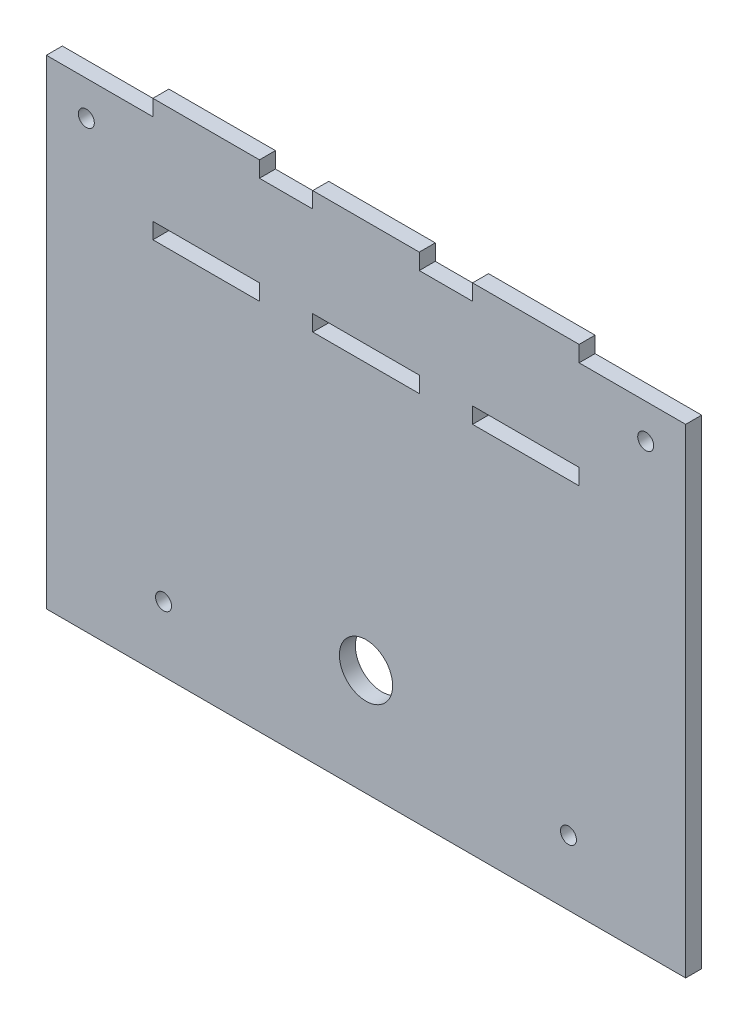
ISO-10303-21;
HEADER;
FILE_DESCRIPTION(('STEP AP214'),'2;1');
FILE_NAME('part.step','',(''),(''),'','','');
FILE_SCHEMA(('AUTOMOTIVE_DESIGN { 1 0 10303 214 1 1 1 1 }'));
ENDSEC;
DATA;
#1=APPLICATION_CONTEXT('core data for automotive mechanical design processes');
#2=APPLICATION_PROTOCOL_DEFINITION('international standard','automotive_design',2000,#1);
#3=PRODUCT_CONTEXT('',#1,'mechanical');
#4=PRODUCT('Part','Part','',(#3));
#5=PRODUCT_RELATED_PRODUCT_CATEGORY('part','',(#4));
#6=PRODUCT_DEFINITION_FORMATION('','',#4);
#7=PRODUCT_DEFINITION_CONTEXT('part definition',#1,'design');
#8=PRODUCT_DEFINITION('design','',#6,#7);
#9=PRODUCT_DEFINITION_SHAPE('','',#8);
#10=(LENGTH_UNIT() NAMED_UNIT(*) SI_UNIT(.MILLI.,.METRE.));
#11=(NAMED_UNIT(*) PLANE_ANGLE_UNIT() SI_UNIT($,.RADIAN.));
#12=(NAMED_UNIT(*) SI_UNIT($,.STERADIAN.) SOLID_ANGLE_UNIT());
#13=UNCERTAINTY_MEASURE_WITH_UNIT(LENGTH_MEASURE(1.E-05),#10,'distance_accuracy_value','');
#14=(GEOMETRIC_REPRESENTATION_CONTEXT(3) GLOBAL_UNCERTAINTY_ASSIGNED_CONTEXT((#13)) GLOBAL_UNIT_ASSIGNED_CONTEXT((#10,
#11,#12)) REPRESENTATION_CONTEXT('',''));
#15=CARTESIAN_POINT('',(0.,0.,0.));
#16=DIRECTION('',(0.,0.,1.));
#17=DIRECTION('',(1.,0.,0.));
#18=AXIS2_PLACEMENT_3D('',#15,#16,#17);
#19=CARTESIAN_POINT('',(-40.,0.,3.));
#20=DIRECTION('',(-1.,0.,0.));
#21=DIRECTION('',(0.,0.,1.));
#22=AXIS2_PLACEMENT_3D('',#19,#20,#21);
#23=PLANE('',#22);
#24=DIRECTION('',(0.,1.,0.));
#25=VECTOR('',#24,1.);
#26=CARTESIAN_POINT('',(-40.,0.,0.));
#27=LINE('',#26,#25);
#28=CARTESIAN_POINT('',(-40.,-23.,0.));
#29=VERTEX_POINT('',#28);
#30=CARTESIAN_POINT('',(-40.,-20.,0.));
#31=VERTEX_POINT('',#30);
#32=EDGE_CURVE('E342',#29,#31,#27,.T.);
#33=ORIENTED_EDGE('',*,*,#32,.T.);
#34=DIRECTION('',(0.,0.,-1.));
#35=VECTOR('',#34,1.);
#36=CARTESIAN_POINT('',(-40.,-20.,3.));
#37=LINE('',#36,#35);
#38=CARTESIAN_POINT('',(-40.,-20.,3.));
#39=VERTEX_POINT('',#38);
#40=EDGE_CURVE('E11',#39,#31,#37,.T.);
#41=ORIENTED_EDGE('',*,*,#40,.F.);
#42=DIRECTION('',(0.,1.,0.));
#43=VECTOR('',#42,1.);
#44=CARTESIAN_POINT('',(-40.,0.,3.));
#45=LINE('',#44,#43);
#46=CARTESIAN_POINT('',(-40.,-23.,3.));
#47=VERTEX_POINT('',#46);
#48=EDGE_CURVE('E242',#47,#39,#45,.T.);
#49=ORIENTED_EDGE('',*,*,#48,.F.);
#50=DIRECTION('',(0.,0.,-1.));
#51=VECTOR('',#50,1.);
#52=CARTESIAN_POINT('',(-40.,-23.,3.));
#53=LINE('',#52,#51);
#54=EDGE_CURVE('E352',#47,#29,#53,.T.);
#55=ORIENTED_EDGE('',*,*,#54,.T.);
#56=EDGE_LOOP('',(#33,#41,#49,#55));
#57=FACE_BOUND('',#56,.T.);
#58=ADVANCED_FACE('F39',(#57),#23,.F.);
#59=CARTESIAN_POINT('',(0.,-20.,3.));
#60=DIRECTION('',(0.,1.,0.));
#61=DIRECTION('',(0.,0.,1.));
#62=AXIS2_PLACEMENT_3D('',#59,#60,#61);
#63=PLANE('',#62);
#64=DIRECTION('',(1.,0.,0.));
#65=VECTOR('',#64,1.);
#66=CARTESIAN_POINT('',(0.,-20.,0.));
#67=LINE('',#66,#65);
#68=CARTESIAN_POINT('',(-20.,-20.,0.));
#69=VERTEX_POINT('',#68);
#70=EDGE_CURVE('E247',#31,#69,#67,.T.);
#71=ORIENTED_EDGE('',*,*,#70,.T.);
#72=DIRECTION('',(0.,0.,-1.));
#73=VECTOR('',#72,1.);
#74=CARTESIAN_POINT('',(-20.,-20.,3.));
#75=LINE('',#74,#73);
#76=CARTESIAN_POINT('',(-20.,-20.,3.));
#77=VERTEX_POINT('',#76);
#78=EDGE_CURVE('E49',#77,#69,#75,.T.);
#79=ORIENTED_EDGE('',*,*,#78,.F.);
#80=DIRECTION('',(1.,0.,0.));
#81=VECTOR('',#80,1.);
#82=CARTESIAN_POINT('',(0.,-20.,3.));
#83=LINE('',#82,#81);
#84=EDGE_CURVE('E235',#39,#77,#83,.T.);
#85=ORIENTED_EDGE('',*,*,#84,.F.);
#86=ORIENTED_EDGE('',*,*,#40,.T.);
#87=EDGE_LOOP('',(#71,#79,#85,#86));
#88=FACE_BOUND('',#87,.T.);
#89=ADVANCED_FACE('F246',(#88),#63,.F.);
#90=CARTESIAN_POINT('',(-20.,0.,3.));
#91=DIRECTION('',(1.,0.,0.));
#92=DIRECTION('',(0.,0.,-1.));
#93=AXIS2_PLACEMENT_3D('',#90,#91,#92);
#94=PLANE('',#93);
#95=DIRECTION('',(0.,-1.,0.));
#96=VECTOR('',#95,1.);
#97=CARTESIAN_POINT('',(-20.,0.,0.));
#98=LINE('',#97,#96);
#99=CARTESIAN_POINT('',(-20.,-23.,0.));
#100=VERTEX_POINT('',#99);
#101=EDGE_CURVE('E147',#69,#100,#98,.T.);
#102=ORIENTED_EDGE('',*,*,#101,.T.);
#103=DIRECTION('',(0.,0.,-1.));
#104=VECTOR('',#103,1.);
#105=CARTESIAN_POINT('',(-20.,-23.,3.));
#106=LINE('',#105,#104);
#107=CARTESIAN_POINT('',(-20.,-23.,3.));
#108=VERTEX_POINT('',#107);
#109=EDGE_CURVE('E248',#108,#100,#106,.T.);
#110=ORIENTED_EDGE('',*,*,#109,.F.);
#111=DIRECTION('',(0.,-1.,0.));
#112=VECTOR('',#111,1.);
#113=CARTESIAN_POINT('',(-20.,0.,3.));
#114=LINE('',#113,#112);
#115=EDGE_CURVE('E240',#77,#108,#114,.T.);
#116=ORIENTED_EDGE('',*,*,#115,.F.);
#117=ORIENTED_EDGE('',*,*,#78,.T.);
#118=EDGE_LOOP('',(#102,#110,#116,#117));
#119=FACE_BOUND('',#118,.T.);
#120=ADVANCED_FACE('F250',(#119),#94,.F.);
#121=CARTESIAN_POINT('',(0.,-20.,3.));
#122=DIRECTION('',(0.,-1.,0.));
#123=DIRECTION('',(0.,0.,-1.));
#124=AXIS2_PLACEMENT_3D('',#121,#122,#123);
#125=PLANE('',#124);
#126=DIRECTION('',(-1.,0.,0.));
#127=VECTOR('',#126,1.);
#128=CARTESIAN_POINT('',(0.,-20.,0.));
#129=LINE('',#128,#127);
#130=CARTESIAN_POINT('',(40.,-20.,0.));
#131=VERTEX_POINT('',#130);
#132=CARTESIAN_POINT('',(20.,-20.,0.));
#133=VERTEX_POINT('',#132);
#134=EDGE_CURVE('E330',#131,#133,#129,.T.);
#135=ORIENTED_EDGE('',*,*,#134,.F.);
#136=DIRECTION('',(0.,0.,-1.));
#137=VECTOR('',#136,1.);
#138=CARTESIAN_POINT('',(40.,-20.,3.));
#139=LINE('',#138,#137);
#140=CARTESIAN_POINT('',(40.,-20.,3.));
#141=VERTEX_POINT('',#140);
#142=EDGE_CURVE('E354',#141,#131,#139,.T.);
#143=ORIENTED_EDGE('',*,*,#142,.F.);
#144=DIRECTION('',(-1.,0.,0.));
#145=VECTOR('',#144,1.);
#146=CARTESIAN_POINT('',(0.,-20.,3.));
#147=LINE('',#146,#145);
#148=CARTESIAN_POINT('',(20.,-20.,3.));
#149=VERTEX_POINT('',#148);
#150=EDGE_CURVE('E789',#141,#149,#147,.T.);
#151=ORIENTED_EDGE('',*,*,#150,.T.);
#152=DIRECTION('',(0.,0.,-1.));
#153=VECTOR('',#152,1.);
#154=CARTESIAN_POINT('',(20.,-20.,3.));
#155=LINE('',#154,#153);
#156=EDGE_CURVE('E356',#149,#133,#155,.T.);
#157=ORIENTED_EDGE('',*,*,#156,.T.);
#158=EDGE_LOOP('',(#135,#143,#151,#157));
#159=FACE_BOUND('',#158,.T.);
#160=ADVANCED_FACE('F458',(#159),#125,.T.);
#161=CARTESIAN_POINT('',(40.,0.,3.));
#162=DIRECTION('',(-1.,0.,0.));
#163=DIRECTION('',(0.,0.,1.));
#164=AXIS2_PLACEMENT_3D('',#161,#162,#163);
#165=PLANE('',#164);
#166=DIRECTION('',(0.,1.,0.));
#167=VECTOR('',#166,1.);
#168=CARTESIAN_POINT('',(40.,0.,0.));
#169=LINE('',#168,#167);
#170=CARTESIAN_POINT('',(40.,-23.,0.));
#171=VERTEX_POINT('',#170);
#172=EDGE_CURVE('E333',#171,#131,#169,.T.);
#173=ORIENTED_EDGE('',*,*,#172,.F.);
#174=DIRECTION('',(0.,0.,-1.));
#175=VECTOR('',#174,1.);
#176=CARTESIAN_POINT('',(40.,-23.,3.));
#177=LINE('',#176,#175);
#178=CARTESIAN_POINT('',(40.,-23.,3.));
#179=VERTEX_POINT('',#178);
#180=EDGE_CURVE('E361',#179,#171,#177,.T.);
#181=ORIENTED_EDGE('',*,*,#180,.F.);
#182=DIRECTION('',(0.,1.,0.));
#183=VECTOR('',#182,1.);
#184=CARTESIAN_POINT('',(40.,0.,3.));
#185=LINE('',#184,#183);
#186=EDGE_CURVE('E792',#179,#141,#185,.T.);
#187=ORIENTED_EDGE('',*,*,#186,.T.);
#188=ORIENTED_EDGE('',*,*,#142,.T.);
#189=EDGE_LOOP('',(#173,#181,#187,#188));
#190=FACE_BOUND('',#189,.T.);
#191=ADVANCED_FACE('F454',(#190),#165,.T.);
#192=CARTESIAN_POINT('',(0.,-23.,3.));
#193=DIRECTION('',(0.,1.,0.));
#194=DIRECTION('',(0.,0.,1.));
#195=AXIS2_PLACEMENT_3D('',#192,#193,#194);
#196=PLANE('',#195);
#197=DIRECTION('',(1.,0.,0.));
#198=VECTOR('',#197,1.);
#199=CARTESIAN_POINT('',(0.,-23.,0.));
#200=LINE('',#199,#198);
#201=CARTESIAN_POINT('',(20.,-23.,0.));
#202=VERTEX_POINT('',#201);
#203=EDGE_CURVE('E336',#202,#171,#200,.T.);
#204=ORIENTED_EDGE('',*,*,#203,.F.);
#205=DIRECTION('',(0.,0.,-1.));
#206=VECTOR('',#205,1.);
#207=CARTESIAN_POINT('',(20.,-23.,3.));
#208=LINE('',#207,#206);
#209=CARTESIAN_POINT('',(20.,-23.,3.));
#210=VERTEX_POINT('',#209);
#211=EDGE_CURVE('E358',#210,#202,#208,.T.);
#212=ORIENTED_EDGE('',*,*,#211,.F.);
#213=DIRECTION('',(1.,0.,0.));
#214=VECTOR('',#213,1.);
#215=CARTESIAN_POINT('',(0.,-23.,3.));
#216=LINE('',#215,#214);
#217=EDGE_CURVE('E799',#210,#179,#216,.T.);
#218=ORIENTED_EDGE('',*,*,#217,.T.);
#219=ORIENTED_EDGE('',*,*,#180,.T.);
#220=EDGE_LOOP('',(#204,#212,#218,#219));
#221=FACE_BOUND('',#220,.T.);
#222=ADVANCED_FACE('F450',(#221),#196,.T.);
#223=CARTESIAN_POINT('',(10.,0.,3.));
#224=DIRECTION('',(1.,0.,0.));
#225=DIRECTION('',(0.,0.,-1.));
#226=AXIS2_PLACEMENT_3D('',#223,#224,#225);
#227=PLANE('',#226);
#228=DIRECTION('',(0.,-1.,0.));
#229=VECTOR('',#228,1.);
#230=CARTESIAN_POINT('',(10.,0.,0.));
#231=LINE('',#230,#229);
#232=CARTESIAN_POINT('',(10.,0.,0.));
#233=VERTEX_POINT('',#232);
#234=CARTESIAN_POINT('',(10.,-3.,0.));
#235=VERTEX_POINT('',#234);
#236=EDGE_CURVE('E273',#233,#235,#231,.T.);
#237=ORIENTED_EDGE('',*,*,#236,.F.);
#238=DIRECTION('',(0.,0.,-1.));
#239=VECTOR('',#238,1.);
#240=CARTESIAN_POINT('',(10.,0.,3.));
#241=LINE('',#240,#239);
#242=CARTESIAN_POINT('',(10.,0.,3.));
#243=VERTEX_POINT('',#242);
#244=EDGE_CURVE('E359',#243,#233,#241,.T.);
#245=ORIENTED_EDGE('',*,*,#244,.F.);
#246=DIRECTION('',(0.,-1.,0.));
#247=VECTOR('',#246,1.);
#248=CARTESIAN_POINT('',(10.,0.,3.));
#249=LINE('',#248,#247);
#250=CARTESIAN_POINT('',(10.,-3.,3.));
#251=VERTEX_POINT('',#250);
#252=EDGE_CURVE('E772',#243,#251,#249,.T.);
#253=ORIENTED_EDGE('',*,*,#252,.T.);
#254=DIRECTION('',(0.,0.,-1.));
#255=VECTOR('',#254,1.);
#256=CARTESIAN_POINT('',(10.,-3.,3.));
#257=LINE('',#256,#255);
#258=EDGE_CURVE('E364',#251,#235,#257,.T.);
#259=ORIENTED_EDGE('',*,*,#258,.T.);
#260=EDGE_LOOP('',(#237,#245,#253,#259));
#261=FACE_BOUND('',#260,.T.);
#262=ADVANCED_FACE('F453',(#261),#227,.T.);
#263=CARTESIAN_POINT('',(0.,0.,3.));
#264=DIRECTION('',(0.,-1.,0.));
#265=DIRECTION('',(0.,0.,-1.));
#266=AXIS2_PLACEMENT_3D('',#263,#264,#265);
#267=PLANE('',#266);
#268=DIRECTION('',(-1.,0.,0.));
#269=VECTOR('',#268,1.);
#270=CARTESIAN_POINT('',(0.,0.,0.));
#271=LINE('',#270,#269);
#272=CARTESIAN_POINT('',(-10.,0.,0.));
#273=VERTEX_POINT('',#272);
#274=EDGE_CURVE('E276',#233,#273,#271,.T.);
#275=ORIENTED_EDGE('',*,*,#274,.T.);
#276=DIRECTION('',(0.,0.,-1.));
#277=VECTOR('',#276,1.);
#278=CARTESIAN_POINT('',(-10.,0.,3.));
#279=LINE('',#278,#277);
#280=CARTESIAN_POINT('',(-10.,0.,3.));
#281=VERTEX_POINT('',#280);
#282=EDGE_CURVE('E398',#281,#273,#279,.T.);
#283=ORIENTED_EDGE('',*,*,#282,.F.);
#284=DIRECTION('',(-1.,0.,0.));
#285=VECTOR('',#284,1.);
#286=CARTESIAN_POINT('',(0.,0.,3.));
#287=LINE('',#286,#285);
#288=EDGE_CURVE('E856',#243,#281,#287,.T.);
#289=ORIENTED_EDGE('',*,*,#288,.F.);
#290=ORIENTED_EDGE('',*,*,#244,.T.);
#291=EDGE_LOOP('',(#275,#283,#289,#290));
#292=FACE_BOUND('',#291,.T.);
#293=ADVANCED_FACE('F529',(#292),#267,.F.);
#294=CARTESIAN_POINT('',(-10.,0.,3.));
#295=DIRECTION('',(1.,0.,0.));
#296=DIRECTION('',(0.,0.,-1.));
#297=AXIS2_PLACEMENT_3D('',#294,#295,#296);
#298=PLANE('',#297);
#299=DIRECTION('',(0.,-1.,0.));
#300=VECTOR('',#299,1.);
#301=CARTESIAN_POINT('',(-10.,0.,0.));
#302=LINE('',#301,#300);
#303=CARTESIAN_POINT('',(-10.,-3.,0.));
#304=VERTEX_POINT('',#303);
#305=EDGE_CURVE('E279',#273,#304,#302,.T.);
#306=ORIENTED_EDGE('',*,*,#305,.T.);
#307=DIRECTION('',(0.,0.,-1.));
#308=VECTOR('',#307,1.);
#309=CARTESIAN_POINT('',(-10.,-3.,3.));
#310=LINE('',#309,#308);
#311=CARTESIAN_POINT('',(-10.,-3.,3.));
#312=VERTEX_POINT('',#311);
#313=EDGE_CURVE('E395',#312,#304,#310,.T.);
#314=ORIENTED_EDGE('',*,*,#313,.F.);
#315=DIRECTION('',(0.,-1.,0.));
#316=VECTOR('',#315,1.);
#317=CARTESIAN_POINT('',(-10.,0.,3.));
#318=LINE('',#317,#316);
#319=EDGE_CURVE('E853',#281,#312,#318,.T.);
#320=ORIENTED_EDGE('',*,*,#319,.F.);
#321=ORIENTED_EDGE('',*,*,#282,.T.);
#322=EDGE_LOOP('',(#306,#314,#320,#321));
#323=FACE_BOUND('',#322,.T.);
#324=ADVANCED_FACE('F525',(#323),#298,.F.);
#325=CARTESIAN_POINT('',(0.,-3.,3.));
#326=DIRECTION('',(0.,-1.,0.));
#327=DIRECTION('',(1.,0.,0.));
#328=AXIS2_PLACEMENT_3D('',#325,#326,#327);
#329=PLANE('',#328);
#330=DIRECTION('',(-1.,0.,0.));
#331=VECTOR('',#330,1.);
#332=CARTESIAN_POINT('',(0.,-3.,0.));
#333=LINE('',#332,#331);
#334=CARTESIAN_POINT('',(-20.,-3.,0.));
#335=VERTEX_POINT('',#334);
#336=EDGE_CURVE('E282',#304,#335,#333,.T.);
#337=ORIENTED_EDGE('',*,*,#336,.T.);
#338=DIRECTION('',(0.,0.,-1.));
#339=VECTOR('',#338,1.);
#340=CARTESIAN_POINT('',(-20.,-3.,3.));
#341=LINE('',#340,#339);
#342=CARTESIAN_POINT('',(-20.,-3.,3.));
#343=VERTEX_POINT('',#342);
#344=EDGE_CURVE('E392',#343,#335,#341,.T.);
#345=ORIENTED_EDGE('',*,*,#344,.F.);
#346=DIRECTION('',(-1.,0.,0.));
#347=VECTOR('',#346,1.);
#348=CARTESIAN_POINT('',(0.,-3.,3.));
#349=LINE('',#348,#347);
#350=EDGE_CURVE('E850',#312,#343,#349,.T.);
#351=ORIENTED_EDGE('',*,*,#350,.F.);
#352=ORIENTED_EDGE('',*,*,#313,.T.);
#353=EDGE_LOOP('',(#337,#345,#351,#352));
#354=FACE_BOUND('',#353,.T.);
#355=ADVANCED_FACE('F521',(#354),#329,.F.);
#356=CARTESIAN_POINT('',(-20.,0.,3.));
#357=DIRECTION('',(-1.,0.,0.));
#358=DIRECTION('',(0.,0.,1.));
#359=AXIS2_PLACEMENT_3D('',#356,#357,#358);
#360=PLANE('',#359);
#361=DIRECTION('',(0.,1.,0.));
#362=VECTOR('',#361,1.);
#363=CARTESIAN_POINT('',(-20.,0.,0.));
#364=LINE('',#363,#362);
#365=CARTESIAN_POINT('',(-20.,0.,0.));
#366=VERTEX_POINT('',#365);
#367=EDGE_CURVE('E285',#335,#366,#364,.T.);
#368=ORIENTED_EDGE('',*,*,#367,.T.);
#369=DIRECTION('',(0.,0.,-1.));
#370=VECTOR('',#369,1.);
#371=CARTESIAN_POINT('',(-20.,0.,3.));
#372=LINE('',#371,#370);
#373=CARTESIAN_POINT('',(-20.,0.,3.));
#374=VERTEX_POINT('',#373);
#375=EDGE_CURVE('E389',#374,#366,#372,.T.);
#376=ORIENTED_EDGE('',*,*,#375,.F.);
#377=DIRECTION('',(0.,1.,0.));
#378=VECTOR('',#377,1.);
#379=CARTESIAN_POINT('',(-20.,0.,3.));
#380=LINE('',#379,#378);
#381=EDGE_CURVE('E847',#343,#374,#380,.T.);
#382=ORIENTED_EDGE('',*,*,#381,.F.);
#383=ORIENTED_EDGE('',*,*,#344,.T.);
#384=EDGE_LOOP('',(#368,#376,#382,#383));
#385=FACE_BOUND('',#384,.T.);
#386=ADVANCED_FACE('F517',(#385),#360,.F.);
#387=CARTESIAN_POINT('',(0.,0.,3.));
#388=DIRECTION('',(0.,-1.,0.));
#389=DIRECTION('',(1.,0.,0.));
#390=AXIS2_PLACEMENT_3D('',#387,#388,#389);
#391=PLANE('',#390);
#392=DIRECTION('',(-1.,0.,0.));
#393=VECTOR('',#392,1.);
#394=CARTESIAN_POINT('',(0.,0.,0.));
#395=LINE('',#394,#393);
#396=CARTESIAN_POINT('',(-40.,0.,0.));
#397=VERTEX_POINT('',#396);
#398=EDGE_CURVE('E288',#366,#397,#395,.T.);
#399=ORIENTED_EDGE('',*,*,#398,.T.);
#400=DIRECTION('',(0.,0.,-1.));
#401=VECTOR('',#400,1.);
#402=CARTESIAN_POINT('',(-40.,0.,3.));
#403=LINE('',#402,#401);
#404=CARTESIAN_POINT('',(-40.,0.,3.));
#405=VERTEX_POINT('',#404);
#406=EDGE_CURVE('E386',#405,#397,#403,.T.);
#407=ORIENTED_EDGE('',*,*,#406,.F.);
#408=DIRECTION('',(-1.,0.,0.));
#409=VECTOR('',#408,1.);
#410=CARTESIAN_POINT('',(0.,0.,3.));
#411=LINE('',#410,#409);
#412=EDGE_CURVE('E844',#374,#405,#411,.T.);
#413=ORIENTED_EDGE('',*,*,#412,.F.);
#414=ORIENTED_EDGE('',*,*,#375,.T.);
#415=EDGE_LOOP('',(#399,#407,#413,#414));
#416=FACE_BOUND('',#415,.T.);
#417=ADVANCED_FACE('F513',(#416),#391,.F.);
#418=CARTESIAN_POINT('',(-40.,0.,3.));
#419=DIRECTION('',(1.,0.,0.));
#420=DIRECTION('',(0.,0.,-1.));
#421=AXIS2_PLACEMENT_3D('',#418,#419,#420);
#422=PLANE('',#421);
#423=DIRECTION('',(0.,-1.,0.));
#424=VECTOR('',#423,1.);
#425=CARTESIAN_POINT('',(-40.,0.,0.));
#426=LINE('',#425,#424);
#427=CARTESIAN_POINT('',(-40.,-3.,0.));
#428=VERTEX_POINT('',#427);
#429=EDGE_CURVE('E291',#397,#428,#426,.T.);
#430=ORIENTED_EDGE('',*,*,#429,.T.);
#431=DIRECTION('',(0.,0.,-1.));
#432=VECTOR('',#431,1.);
#433=CARTESIAN_POINT('',(-40.,-3.,3.));
#434=LINE('',#433,#432);
#435=CARTESIAN_POINT('',(-40.,-3.,3.));
#436=VERTEX_POINT('',#435);
#437=EDGE_CURVE('E383',#436,#428,#434,.T.);
#438=ORIENTED_EDGE('',*,*,#437,.F.);
#439=DIRECTION('',(0.,-1.,0.));
#440=VECTOR('',#439,1.);
#441=CARTESIAN_POINT('',(-40.,0.,3.));
#442=LINE('',#441,#440);
#443=EDGE_CURVE('E841',#405,#436,#442,.T.);
#444=ORIENTED_EDGE('',*,*,#443,.F.);
#445=ORIENTED_EDGE('',*,*,#406,.T.);
#446=EDGE_LOOP('',(#430,#438,#444,#445));
#447=FACE_BOUND('',#446,.T.);
#448=ADVANCED_FACE('F509',(#447),#422,.F.);
#449=CARTESIAN_POINT('',(0.,-3.,3.));
#450=DIRECTION('',(0.,-1.,0.));
#451=DIRECTION('',(1.,0.,0.));
#452=AXIS2_PLACEMENT_3D('',#449,#450,#451);
#453=PLANE('',#452);
#454=DIRECTION('',(-1.,0.,0.));
#455=VECTOR('',#454,1.);
#456=CARTESIAN_POINT('',(0.,-3.,0.));
#457=LINE('',#456,#455);
#458=CARTESIAN_POINT('',(-60.,-3.00000000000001,0.));
#459=VERTEX_POINT('',#458);
#460=EDGE_CURVE('E294',#428,#459,#457,.T.);
#461=ORIENTED_EDGE('',*,*,#460,.T.);
#462=DIRECTION('',(0.,0.,-1.));
#463=VECTOR('',#462,1.);
#464=CARTESIAN_POINT('',(-60.,-3.00000000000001,3.));
#465=LINE('',#464,#463);
#466=CARTESIAN_POINT('',(-60.,-3.00000000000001,3.));
#467=VERTEX_POINT('',#466);
#468=EDGE_CURVE('E380',#467,#459,#465,.T.);
#469=ORIENTED_EDGE('',*,*,#468,.F.);
#470=DIRECTION('',(-1.,0.,0.));
#471=VECTOR('',#470,1.);
#472=CARTESIAN_POINT('',(0.,-3.,3.));
#473=LINE('',#472,#471);
#474=EDGE_CURVE('E838',#436,#467,#473,.T.);
#475=ORIENTED_EDGE('',*,*,#474,.F.);
#476=ORIENTED_EDGE('',*,*,#437,.T.);
#477=EDGE_LOOP('',(#461,#469,#475,#476));
#478=FACE_BOUND('',#477,.T.);
#479=ADVANCED_FACE('F505',(#478),#453,.F.);
#480=CARTESIAN_POINT('',(-60.,0.,3.));
#481=DIRECTION('',(1.,0.,0.));
#482=DIRECTION('',(0.,1.,0.));
#483=AXIS2_PLACEMENT_3D('',#480,#481,#482);
#484=PLANE('',#483);
#485=DIRECTION('',(0.,-1.,0.));
#486=VECTOR('',#485,1.);
#487=CARTESIAN_POINT('',(-60.,0.,0.));
#488=LINE('',#487,#486);
#489=CARTESIAN_POINT('',(-60.,-93.,0.));
#490=VERTEX_POINT('',#489);
#491=EDGE_CURVE('E297',#459,#490,#488,.T.);
#492=ORIENTED_EDGE('',*,*,#491,.T.);
#493=DIRECTION('',(0.,0.,-1.));
#494=VECTOR('',#493,1.);
#495=CARTESIAN_POINT('',(-60.,-93.,3.));
#496=LINE('',#495,#494);
#497=CARTESIAN_POINT('',(-60.,-93.,3.));
#498=VERTEX_POINT('',#497);
#499=EDGE_CURVE('E378',#498,#490,#496,.T.);
#500=ORIENTED_EDGE('',*,*,#499,.F.);
#501=DIRECTION('',(0.,-1.,0.));
#502=VECTOR('',#501,1.);
#503=CARTESIAN_POINT('',(-60.,0.,3.));
#504=LINE('',#503,#502);
#505=EDGE_CURVE('E836',#467,#498,#504,.T.);
#506=ORIENTED_EDGE('',*,*,#505,.F.);
#507=ORIENTED_EDGE('',*,*,#468,.T.);
#508=EDGE_LOOP('',(#492,#500,#506,#507));
#509=FACE_BOUND('',#508,.T.);
#510=ADVANCED_FACE('F501',(#509),#484,.F.);
#511=CARTESIAN_POINT('',(0.,-93.,3.));
#512=DIRECTION('',(0.,-1.,0.));
#513=DIRECTION('',(1.,0.,0.));
#514=AXIS2_PLACEMENT_3D('',#511,#512,#513);
#515=PLANE('',#514);
#516=DIRECTION('',(-1.,0.,0.));
#517=VECTOR('',#516,1.);
#518=CARTESIAN_POINT('',(0.,-93.,0.));
#519=LINE('',#518,#517);
#520=CARTESIAN_POINT('',(60.,-93.,0.));
#521=VERTEX_POINT('',#520);
#522=EDGE_CURVE('E300',#521,#490,#519,.T.);
#523=ORIENTED_EDGE('',*,*,#522,.F.);
#524=DIRECTION('',(0.,0.,-1.));
#525=VECTOR('',#524,1.);
#526=CARTESIAN_POINT('',(60.,-93.,3.));
#527=LINE('',#526,#525);
#528=CARTESIAN_POINT('',(60.,-93.,3.));
#529=VERTEX_POINT('',#528);
#530=EDGE_CURVE('E376',#529,#521,#527,.T.);
#531=ORIENTED_EDGE('',*,*,#530,.F.);
#532=DIRECTION('',(-1.,0.,0.));
#533=VECTOR('',#532,1.);
#534=CARTESIAN_POINT('',(0.,-93.,3.));
#535=LINE('',#534,#533);
#536=EDGE_CURVE('E833',#529,#498,#535,.T.);
#537=ORIENTED_EDGE('',*,*,#536,.T.);
#538=ORIENTED_EDGE('',*,*,#499,.T.);
#539=EDGE_LOOP('',(#523,#531,#537,#538));
#540=FACE_BOUND('',#539,.T.);
#541=ADVANCED_FACE('F497',(#540),#515,.T.);
#542=CARTESIAN_POINT('',(60.,0.,3.));
#543=DIRECTION('',(1.,0.,0.));
#544=DIRECTION('',(0.,1.,0.));
#545=AXIS2_PLACEMENT_3D('',#542,#543,#544);
#546=PLANE('',#545);
#547=DIRECTION('',(0.,-1.,0.));
#548=VECTOR('',#547,1.);
#549=CARTESIAN_POINT('',(60.,0.,0.));
#550=LINE('',#549,#548);
#551=CARTESIAN_POINT('',(60.,-3.,0.));
#552=VERTEX_POINT('',#551);
#553=EDGE_CURVE('E303',#552,#521,#550,.T.);
#554=ORIENTED_EDGE('',*,*,#553,.F.);
#555=DIRECTION('',(0.,0.,-1.));
#556=VECTOR('',#555,1.);
#557=CARTESIAN_POINT('',(60.,-3.,3.));
#558=LINE('',#557,#556);
#559=CARTESIAN_POINT('',(60.,-3.,3.));
#560=VERTEX_POINT('',#559);
#561=EDGE_CURVE('E374',#560,#552,#558,.T.);
#562=ORIENTED_EDGE('',*,*,#561,.F.);
#563=DIRECTION('',(0.,-1.,0.));
#564=VECTOR('',#563,1.);
#565=CARTESIAN_POINT('',(60.,0.,3.));
#566=LINE('',#565,#564);
#567=EDGE_CURVE('E830',#560,#529,#566,.T.);
#568=ORIENTED_EDGE('',*,*,#567,.T.);
#569=ORIENTED_EDGE('',*,*,#530,.T.);
#570=EDGE_LOOP('',(#554,#562,#568,#569));
#571=FACE_BOUND('',#570,.T.);
#572=ADVANCED_FACE('F493',(#571),#546,.T.);
#573=CARTESIAN_POINT('',(0.,-3.,3.));
#574=DIRECTION('',(0.,1.,0.));
#575=DIRECTION('',(0.,0.,1.));
#576=AXIS2_PLACEMENT_3D('',#573,#574,#575);
#577=PLANE('',#576);
#578=DIRECTION('',(1.,0.,0.));
#579=VECTOR('',#578,1.);
#580=CARTESIAN_POINT('',(0.,-3.,0.));
#581=LINE('',#580,#579);
#582=CARTESIAN_POINT('',(40.,-3.,0.));
#583=VERTEX_POINT('',#582);
#584=EDGE_CURVE('E306',#583,#552,#581,.T.);
#585=ORIENTED_EDGE('',*,*,#584,.F.);
#586=DIRECTION('',(0.,0.,-1.));
#587=VECTOR('',#586,1.);
#588=CARTESIAN_POINT('',(40.,-3.,3.));
#589=LINE('',#588,#587);
#590=CARTESIAN_POINT('',(40.,-3.,3.));
#591=VERTEX_POINT('',#590);
#592=EDGE_CURVE('E372',#591,#583,#589,.T.);
#593=ORIENTED_EDGE('',*,*,#592,.F.);
#594=DIRECTION('',(1.,0.,0.));
#595=VECTOR('',#594,1.);
#596=CARTESIAN_POINT('',(0.,-3.,3.));
#597=LINE('',#596,#595);
#598=EDGE_CURVE('E827',#591,#560,#597,.T.);
#599=ORIENTED_EDGE('',*,*,#598,.T.);
#600=ORIENTED_EDGE('',*,*,#561,.T.);
#601=EDGE_LOOP('',(#585,#593,#599,#600));
#602=FACE_BOUND('',#601,.T.);
#603=ADVANCED_FACE('F489',(#602),#577,.T.);
#604=CARTESIAN_POINT('',(40.,0.,3.));
#605=DIRECTION('',(1.,0.,0.));
#606=DIRECTION('',(0.,0.,-1.));
#607=AXIS2_PLACEMENT_3D('',#604,#605,#606);
#608=PLANE('',#607);
#609=DIRECTION('',(0.,-1.,0.));
#610=VECTOR('',#609,1.);
#611=CARTESIAN_POINT('',(40.,0.,0.));
#612=LINE('',#611,#610);
#613=CARTESIAN_POINT('',(40.,0.,0.));
#614=VERTEX_POINT('',#613);
#615=EDGE_CURVE('E309',#614,#583,#612,.T.);
#616=ORIENTED_EDGE('',*,*,#615,.F.);
#617=DIRECTION('',(0.,0.,-1.));
#618=VECTOR('',#617,1.);
#619=CARTESIAN_POINT('',(40.,0.,3.));
#620=LINE('',#619,#618);
#621=CARTESIAN_POINT('',(40.,0.,3.));
#622=VERTEX_POINT('',#621);
#623=EDGE_CURVE('E370',#622,#614,#620,.T.);
#624=ORIENTED_EDGE('',*,*,#623,.F.);
#625=DIRECTION('',(0.,-1.,0.));
#626=VECTOR('',#625,1.);
#627=CARTESIAN_POINT('',(40.,0.,3.));
#628=LINE('',#627,#626);
#629=EDGE_CURVE('E824',#622,#591,#628,.T.);
#630=ORIENTED_EDGE('',*,*,#629,.T.);
#631=ORIENTED_EDGE('',*,*,#592,.T.);
#632=EDGE_LOOP('',(#616,#624,#630,#631));
#633=FACE_BOUND('',#632,.T.);
#634=ADVANCED_FACE('F485',(#633),#608,.T.);
#635=CARTESIAN_POINT('',(0.,0.,3.));
#636=DIRECTION('',(0.,1.,0.));
#637=DIRECTION('',(0.,0.,1.));
#638=AXIS2_PLACEMENT_3D('',#635,#636,#637);
#639=PLANE('',#638);
#640=DIRECTION('',(1.,0.,0.));
#641=VECTOR('',#640,1.);
#642=CARTESIAN_POINT('',(0.,0.,0.));
#643=LINE('',#642,#641);
#644=CARTESIAN_POINT('',(20.,0.,0.));
#645=VERTEX_POINT('',#644);
#646=EDGE_CURVE('E312',#645,#614,#643,.T.);
#647=ORIENTED_EDGE('',*,*,#646,.F.);
#648=DIRECTION('',(0.,0.,-1.));
#649=VECTOR('',#648,1.);
#650=CARTESIAN_POINT('',(20.,0.,3.));
#651=LINE('',#650,#649);
#652=CARTESIAN_POINT('',(20.,0.,3.));
#653=VERTEX_POINT('',#652);
#654=EDGE_CURVE('E368',#653,#645,#651,.T.);
#655=ORIENTED_EDGE('',*,*,#654,.F.);
#656=DIRECTION('',(1.,0.,0.));
#657=VECTOR('',#656,1.);
#658=CARTESIAN_POINT('',(0.,0.,3.));
#659=LINE('',#658,#657);
#660=EDGE_CURVE('E821',#653,#622,#659,.T.);
#661=ORIENTED_EDGE('',*,*,#660,.T.);
#662=ORIENTED_EDGE('',*,*,#623,.T.);
#663=EDGE_LOOP('',(#647,#655,#661,#662));
#664=FACE_BOUND('',#663,.T.);
#665=ADVANCED_FACE('F481',(#664),#639,.T.);
#666=CARTESIAN_POINT('',(20.,0.,3.));
#667=DIRECTION('',(-1.,0.,0.));
#668=DIRECTION('',(0.,0.,1.));
#669=AXIS2_PLACEMENT_3D('',#666,#667,#668);
#670=PLANE('',#669);
#671=DIRECTION('',(0.,1.,0.));
#672=VECTOR('',#671,1.);
#673=CARTESIAN_POINT('',(20.,0.,0.));
#674=LINE('',#673,#672);
#675=CARTESIAN_POINT('',(20.,-3.,0.));
#676=VERTEX_POINT('',#675);
#677=EDGE_CURVE('E315',#676,#645,#674,.T.);
#678=ORIENTED_EDGE('',*,*,#677,.F.);
#679=DIRECTION('',(0.,0.,-1.));
#680=VECTOR('',#679,1.);
#681=CARTESIAN_POINT('',(20.,-3.,3.));
#682=LINE('',#681,#680);
#683=CARTESIAN_POINT('',(20.,-3.,3.));
#684=VERTEX_POINT('',#683);
#685=EDGE_CURVE('E366',#684,#676,#682,.T.);
#686=ORIENTED_EDGE('',*,*,#685,.F.);
#687=DIRECTION('',(0.,1.,0.));
#688=VECTOR('',#687,1.);
#689=CARTESIAN_POINT('',(20.,0.,3.));
#690=LINE('',#689,#688);
#691=EDGE_CURVE('E818',#684,#653,#690,.T.);
#692=ORIENTED_EDGE('',*,*,#691,.T.);
#693=ORIENTED_EDGE('',*,*,#654,.T.);
#694=EDGE_LOOP('',(#678,#686,#692,#693));
#695=FACE_BOUND('',#694,.T.);
#696=ADVANCED_FACE('F478',(#695),#670,.T.);
#697=CARTESIAN_POINT('',(0.,-20.,3.));
#698=DIRECTION('',(0.,1.,0.));
#699=DIRECTION('',(0.,0.,1.));
#700=AXIS2_PLACEMENT_3D('',#697,#698,#699);
#701=PLANE('',#700);
#702=DIRECTION('',(1.,0.,0.));
#703=VECTOR('',#702,1.);
#704=CARTESIAN_POINT('',(0.,-20.,0.));
#705=LINE('',#704,#703);
#706=CARTESIAN_POINT('',(-10.,-20.,0.));
#707=VERTEX_POINT('',#706);
#708=CARTESIAN_POINT('',(10.,-20.,0.));
#709=VERTEX_POINT('',#708);
#710=EDGE_CURVE('E262',#707,#709,#705,.T.);
#711=ORIENTED_EDGE('',*,*,#710,.T.);
#712=DIRECTION('',(0.,0.,-1.));
#713=VECTOR('',#712,1.);
#714=CARTESIAN_POINT('',(10.,-20.,3.));
#715=LINE('',#714,#713);
#716=CARTESIAN_POINT('',(10.,-20.,3.));
#717=VERTEX_POINT('',#716);
#718=EDGE_CURVE('E43',#717,#709,#715,.T.);
#719=ORIENTED_EDGE('',*,*,#718,.F.);
#720=DIRECTION('',(1.,0.,0.));
#721=VECTOR('',#720,1.);
#722=CARTESIAN_POINT('',(0.,-20.,3.));
#723=LINE('',#722,#721);
#724=CARTESIAN_POINT('',(-10.,-20.,3.));
#725=VERTEX_POINT('',#724);
#726=EDGE_CURVE('E766',#725,#717,#723,.T.);
#727=ORIENTED_EDGE('',*,*,#726,.F.);
#728=DIRECTION('',(0.,0.,-1.));
#729=VECTOR('',#728,1.);
#730=CARTESIAN_POINT('',(-10.,-20.,3.));
#731=LINE('',#730,#729);
#732=EDGE_CURVE('E258',#725,#707,#731,.T.);
#733=ORIENTED_EDGE('',*,*,#732,.T.);
#734=EDGE_LOOP('',(#711,#719,#727,#733));
#735=FACE_BOUND('',#734,.T.);
#736=ADVANCED_FACE('F414',(#735),#701,.F.);
#737=CARTESIAN_POINT('',(10.,0.,3.));
#738=DIRECTION('',(1.,0.,0.));
#739=DIRECTION('',(0.,0.,-1.));
#740=AXIS2_PLACEMENT_3D('',#737,#738,#739);
#741=PLANE('',#740);
#742=DIRECTION('',(0.,-1.,0.));
#743=VECTOR('',#742,1.);
#744=CARTESIAN_POINT('',(10.,0.,0.));
#745=LINE('',#744,#743);
#746=CARTESIAN_POINT('',(10.,-23.,0.));
#747=VERTEX_POINT('',#746);
#748=EDGE_CURVE('E265',#709,#747,#745,.T.);
#749=ORIENTED_EDGE('',*,*,#748,.T.);
#750=DIRECTION('',(0.,0.,-1.));
#751=VECTOR('',#750,1.);
#752=CARTESIAN_POINT('',(10.,-23.,3.));
#753=LINE('',#752,#751);
#754=CARTESIAN_POINT('',(10.,-23.,3.));
#755=VERTEX_POINT('',#754);
#756=EDGE_CURVE('E404',#755,#747,#753,.T.);
#757=ORIENTED_EDGE('',*,*,#756,.F.);
#758=DIRECTION('',(0.,-1.,0.));
#759=VECTOR('',#758,1.);
#760=CARTESIAN_POINT('',(10.,0.,3.));
#761=LINE('',#760,#759);
#762=EDGE_CURVE('E162',#717,#755,#761,.T.);
#763=ORIENTED_EDGE('',*,*,#762,.F.);
#764=ORIENTED_EDGE('',*,*,#718,.T.);
#765=EDGE_LOOP('',(#749,#757,#763,#764));
#766=FACE_BOUND('',#765,.T.);
#767=ADVANCED_FACE('F410',(#766),#741,.F.);
#768=CARTESIAN_POINT('',(0.,-23.,3.));
#769=DIRECTION('',(0.,-1.,0.));
#770=DIRECTION('',(0.,0.,-1.));
#771=AXIS2_PLACEMENT_3D('',#768,#769,#770);
#772=PLANE('',#771);
#773=DIRECTION('',(-1.,0.,0.));
#774=VECTOR('',#773,1.);
#775=CARTESIAN_POINT('',(0.,-23.,0.));
#776=LINE('',#775,#774);
#777=CARTESIAN_POINT('',(-9.99999999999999,-23.,0.));
#778=VERTEX_POINT('',#777);
#779=EDGE_CURVE('E267',#747,#778,#776,.T.);
#780=ORIENTED_EDGE('',*,*,#779,.T.);
#781=DIRECTION('',(0.,0.,-1.));
#782=VECTOR('',#781,1.);
#783=CARTESIAN_POINT('',(-9.99999999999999,-23.,3.));
#784=LINE('',#783,#782);
#785=CARTESIAN_POINT('',(-9.99999999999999,-23.,3.));
#786=VERTEX_POINT('',#785);
#787=EDGE_CURVE('E403',#786,#778,#784,.T.);
#788=ORIENTED_EDGE('',*,*,#787,.F.);
#789=DIRECTION('',(-1.,0.,0.));
#790=VECTOR('',#789,1.);
#791=CARTESIAN_POINT('',(0.,-23.,3.));
#792=LINE('',#791,#790);
#793=EDGE_CURVE('E860',#755,#786,#792,.T.);
#794=ORIENTED_EDGE('',*,*,#793,.F.);
#795=ORIENTED_EDGE('',*,*,#756,.T.);
#796=EDGE_LOOP('',(#780,#788,#794,#795));
#797=FACE_BOUND('',#796,.T.);
#798=ADVANCED_FACE('F425',(#797),#772,.F.);
#799=CARTESIAN_POINT('',(0.,-23.,3.));
#800=DIRECTION('',(0.,-1.,0.));
#801=DIRECTION('',(0.,0.,-1.));
#802=AXIS2_PLACEMENT_3D('',#799,#800,#801);
#803=PLANE('',#802);
#804=DIRECTION('',(-1.,0.,0.));
#805=VECTOR('',#804,1.);
#806=CARTESIAN_POINT('',(0.,-23.,0.));
#807=LINE('',#806,#805);
#808=EDGE_CURVE('E153',#100,#29,#807,.T.);
#809=ORIENTED_EDGE('',*,*,#808,.T.);
#810=ORIENTED_EDGE('',*,*,#54,.F.);
#811=DIRECTION('',(-1.,0.,0.));
#812=VECTOR('',#811,1.);
#813=CARTESIAN_POINT('',(0.,-23.,3.));
#814=LINE('',#813,#812);
#815=EDGE_CURVE('E58',#108,#47,#814,.T.);
#816=ORIENTED_EDGE('',*,*,#815,.F.);
#817=ORIENTED_EDGE('',*,*,#109,.T.);
#818=EDGE_LOOP('',(#809,#810,#816,#817));
#819=FACE_BOUND('',#818,.T.);
#820=ADVANCED_FACE('F427',(#819),#803,.F.);
#821=CARTESIAN_POINT('',(20.,0.,3.));
#822=DIRECTION('',(1.,0.,0.));
#823=DIRECTION('',(0.,0.,-1.));
#824=AXIS2_PLACEMENT_3D('',#821,#822,#823);
#825=PLANE('',#824);
#826=DIRECTION('',(0.,-1.,0.));
#827=VECTOR('',#826,1.);
#828=CARTESIAN_POINT('',(20.,0.,0.));
#829=LINE('',#828,#827);
#830=EDGE_CURVE('E339',#133,#202,#829,.T.);
#831=ORIENTED_EDGE('',*,*,#830,.F.);
#832=ORIENTED_EDGE('',*,*,#156,.F.);
#833=DIRECTION('',(0.,-1.,0.));
#834=VECTOR('',#833,1.);
#835=CARTESIAN_POINT('',(20.,0.,3.));
#836=LINE('',#835,#834);
#837=EDGE_CURVE('E795',#149,#210,#836,.T.);
#838=ORIENTED_EDGE('',*,*,#837,.T.);
#839=ORIENTED_EDGE('',*,*,#211,.T.);
#840=EDGE_LOOP('',(#831,#832,#838,#839));
#841=FACE_BOUND('',#840,.T.);
#842=ADVANCED_FACE('F433',(#841),#825,.T.);
#843=CARTESIAN_POINT('',(52.5,-9.5,3.));
#844=DIRECTION('',(0.,0.,-1.));
#845=DIRECTION('',(-1.,0.,0.));
#846=AXIS2_PLACEMENT_3D('',#843,#844,#845);
#847=CYLINDRICAL_SURFACE('',#846,1.5);
#848=CARTESIAN_POINT('',(52.5,-9.5,3.));
#849=DIRECTION('',(0.,0.,1.));
#850=DIRECTION('',(1.,0.,0.));
#851=AXIS2_PLACEMENT_3D('',#848,#849,#850);
#852=CIRCLE('',#851,1.5);
#853=CARTESIAN_POINT('',(54.,-9.5,3.));
#854=VERTEX_POINT('',#853);
#855=EDGE_CURVE('E784',#854,#854,#852,.T.);
#856=ORIENTED_EDGE('',*,*,#855,.T.);
#857=EDGE_LOOP('',(#856));
#858=FACE_BOUND('',#857,.T.);
#859=CARTESIAN_POINT('',(52.5,-9.5,0.));
#860=DIRECTION('',(0.,0.,1.));
#861=DIRECTION('',(1.,0.,0.));
#862=AXIS2_PLACEMENT_3D('',#859,#860,#861);
#863=CIRCLE('',#862,1.5);
#864=CARTESIAN_POINT('',(54.,-9.5,0.));
#865=VERTEX_POINT('',#864);
#866=EDGE_CURVE('E327',#865,#865,#863,.T.);
#867=ORIENTED_EDGE('',*,*,#866,.F.);
#868=EDGE_LOOP('',(#867));
#869=FACE_BOUND('',#868,.T.);
#870=ADVANCED_FACE('F448',(#858,#869),#847,.F.);
#871=CARTESIAN_POINT('',(38.,-80.8,3.));
#872=DIRECTION('',(0.,0.,-1.));
#873=DIRECTION('',(-1.,0.,0.));
#874=AXIS2_PLACEMENT_3D('',#871,#872,#873);
#875=CYLINDRICAL_SURFACE('',#874,1.5);
#876=CARTESIAN_POINT('',(38.,-80.8,3.));
#877=DIRECTION('',(0.,0.,1.));
#878=DIRECTION('',(1.,0.,0.));
#879=AXIS2_PLACEMENT_3D('',#876,#877,#878);
#880=CIRCLE('',#879,1.5);
#881=CARTESIAN_POINT('',(39.5,-80.8,3.));
#882=VERTEX_POINT('',#881);
#883=EDGE_CURVE('E780',#882,#882,#880,.T.);
#884=ORIENTED_EDGE('',*,*,#883,.T.);
#885=EDGE_LOOP('',(#884));
#886=FACE_BOUND('',#885,.T.);
#887=CARTESIAN_POINT('',(38.,-80.8,0.));
#888=DIRECTION('',(0.,0.,1.));
#889=DIRECTION('',(1.,0.,0.));
#890=AXIS2_PLACEMENT_3D('',#887,#888,#889);
#891=CIRCLE('',#890,1.5);
#892=CARTESIAN_POINT('',(39.5,-80.8,0.));
#893=VERTEX_POINT('',#892);
#894=EDGE_CURVE('E324',#893,#893,#891,.T.);
#895=ORIENTED_EDGE('',*,*,#894,.F.);
#896=EDGE_LOOP('',(#895));
#897=FACE_BOUND('',#896,.T.);
#898=ADVANCED_FACE('F465',(#886,#897),#875,.F.);
#899=CARTESIAN_POINT('',(-38.,-80.8,3.));
#900=DIRECTION('',(0.,0.,-1.));
#901=DIRECTION('',(-1.,0.,0.));
#902=AXIS2_PLACEMENT_3D('',#899,#900,#901);
#903=CYLINDRICAL_SURFACE('',#902,1.5);
#904=CARTESIAN_POINT('',(-38.,-80.8,3.));
#905=DIRECTION('',(0.,0.,1.));
#906=DIRECTION('',(1.,0.,0.));
#907=AXIS2_PLACEMENT_3D('',#904,#905,#906);
#908=CIRCLE('',#907,1.5);
#909=CARTESIAN_POINT('',(-36.5,-80.8,3.));
#910=VERTEX_POINT('',#909);
#911=EDGE_CURVE('E776',#910,#910,#908,.F.);
#912=ORIENTED_EDGE('',*,*,#911,.F.);
#913=EDGE_LOOP('',(#912));
#914=FACE_BOUND('',#913,.T.);
#915=CARTESIAN_POINT('',(-38.,-80.8,0.));
#916=DIRECTION('',(0.,0.,1.));
#917=DIRECTION('',(1.,0.,0.));
#918=AXIS2_PLACEMENT_3D('',#915,#916,#917);
#919=CIRCLE('',#918,1.5);
#920=CARTESIAN_POINT('',(-36.5,-80.8,0.));
#921=VERTEX_POINT('',#920);
#922=EDGE_CURVE('E321',#921,#921,#919,.F.);
#923=ORIENTED_EDGE('',*,*,#922,.T.);
#924=EDGE_LOOP('',(#923));
#925=FACE_BOUND('',#924,.T.);
#926=ADVANCED_FACE('F469',(#914,#925),#903,.F.);
#927=CARTESIAN_POINT('',(0.,-3.,3.));
#928=DIRECTION('',(0.,1.,0.));
#929=DIRECTION('',(0.,0.,1.));
#930=AXIS2_PLACEMENT_3D('',#927,#928,#929);
#931=PLANE('',#930);
#932=DIRECTION('',(1.,0.,0.));
#933=VECTOR('',#932,1.);
#934=CARTESIAN_POINT('',(0.,-3.,0.));
#935=LINE('',#934,#933);
#936=EDGE_CURVE('E318',#235,#676,#935,.T.);
#937=ORIENTED_EDGE('',*,*,#936,.F.);
#938=ORIENTED_EDGE('',*,*,#258,.F.);
#939=DIRECTION('',(1.,0.,0.));
#940=VECTOR('',#939,1.);
#941=CARTESIAN_POINT('',(0.,-3.,3.));
#942=LINE('',#941,#940);
#943=EDGE_CURVE('E815',#251,#684,#942,.T.);
#944=ORIENTED_EDGE('',*,*,#943,.T.);
#945=ORIENTED_EDGE('',*,*,#685,.T.);
#946=EDGE_LOOP('',(#937,#938,#944,#945));
#947=FACE_BOUND('',#946,.T.);
#948=ADVANCED_FACE('F473',(#947),#931,.T.);
#949=CARTESIAN_POINT('',(-10.,0.,3.));
#950=DIRECTION('',(1.,0.,0.));
#951=DIRECTION('',(0.,1.,0.));
#952=AXIS2_PLACEMENT_3D('',#949,#950,#951);
#953=PLANE('',#952);
#954=DIRECTION('',(0.,-1.,0.));
#955=VECTOR('',#954,1.);
#956=CARTESIAN_POINT('',(-10.,0.,0.));
#957=LINE('',#956,#955);
#958=EDGE_CURVE('E270',#707,#778,#957,.T.);
#959=ORIENTED_EDGE('',*,*,#958,.F.);
#960=ORIENTED_EDGE('',*,*,#732,.F.);
#961=DIRECTION('',(0.,-1.,0.));
#962=VECTOR('',#961,1.);
#963=CARTESIAN_POINT('',(-10.,0.,3.));
#964=LINE('',#963,#962);
#965=EDGE_CURVE('E424',#725,#786,#964,.T.);
#966=ORIENTED_EDGE('',*,*,#965,.T.);
#967=ORIENTED_EDGE('',*,*,#787,.T.);
#968=EDGE_LOOP('',(#959,#960,#966,#967));
#969=FACE_BOUND('',#968,.T.);
#970=ADVANCED_FACE('F420',(#969),#953,.T.);
#971=CARTESIAN_POINT('',(0.,-73.,3.));
#972=DIRECTION('',(0.,0.,-1.));
#973=DIRECTION('',(-1.,0.,0.));
#974=AXIS2_PLACEMENT_3D('',#971,#972,#973);
#975=CYLINDRICAL_SURFACE('',#974,5.);
#976=CARTESIAN_POINT('',(0.,-73.,3.));
#977=DIRECTION('',(0.,0.,1.));
#978=DIRECTION('',(1.,0.,0.));
#979=AXIS2_PLACEMENT_3D('',#976,#977,#978);
#980=CIRCLE('',#979,5.);
#981=CARTESIAN_POINT('',(5.00000000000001,-73.,3.));
#982=VERTEX_POINT('',#981);
#983=EDGE_CURVE('E351',#982,#982,#980,.T.);
#984=ORIENTED_EDGE('',*,*,#983,.T.);
#985=EDGE_LOOP('',(#984));
#986=FACE_BOUND('',#985,.T.);
#987=CARTESIAN_POINT('',(0.,-73.,0.));
#988=DIRECTION('',(0.,0.,1.));
#989=DIRECTION('',(1.,0.,0.));
#990=AXIS2_PLACEMENT_3D('',#987,#988,#989);
#991=CIRCLE('',#990,5.);
#992=CARTESIAN_POINT('',(5.00000000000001,-73.,0.));
#993=VERTEX_POINT('',#992);
#994=EDGE_CURVE('E259',#993,#993,#991,.T.);
#995=ORIENTED_EDGE('',*,*,#994,.F.);
#996=EDGE_LOOP('',(#995));
#997=FACE_BOUND('',#996,.T.);
#998=ADVANCED_FACE('F41',(#986,#997),#975,.F.);
#999=CARTESIAN_POINT('',(-52.5,-9.50000000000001,3.));
#1000=DIRECTION('',(0.,0.,-1.));
#1001=DIRECTION('',(-1.,0.,0.));
#1002=AXIS2_PLACEMENT_3D('',#999,#1000,#1001);
#1003=CYLINDRICAL_SURFACE('',#1002,1.5);
#1004=CARTESIAN_POINT('',(-52.5,-9.50000000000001,3.));
#1005=DIRECTION('',(0.,0.,1.));
#1006=DIRECTION('',(1.,0.,0.));
#1007=AXIS2_PLACEMENT_3D('',#1004,#1005,#1006);
#1008=CIRCLE('',#1007,1.5);
#1009=CARTESIAN_POINT('',(-51.,-9.50000000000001,3.));
#1010=VERTEX_POINT('',#1009);
#1011=EDGE_CURVE('E252',#1010,#1010,#1008,.F.);
#1012=ORIENTED_EDGE('',*,*,#1011,.F.);
#1013=EDGE_LOOP('',(#1012));
#1014=FACE_BOUND('',#1013,.T.);
#1015=CARTESIAN_POINT('',(-52.5,-9.50000000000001,0.));
#1016=DIRECTION('',(0.,0.,1.));
#1017=DIRECTION('',(1.,0.,0.));
#1018=AXIS2_PLACEMENT_3D('',#1015,#1016,#1017);
#1019=CIRCLE('',#1018,1.5);
#1020=CARTESIAN_POINT('',(-51.,-9.50000000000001,0.));
#1021=VERTEX_POINT('',#1020);
#1022=EDGE_CURVE('E348',#1021,#1021,#1019,.F.);
#1023=ORIENTED_EDGE('',*,*,#1022,.T.);
#1024=EDGE_LOOP('',(#1023));
#1025=FACE_BOUND('',#1024,.T.);
#1026=ADVANCED_FACE('F540',(#1014,#1025),#1003,.F.);
#1027=CARTESIAN_POINT('',(0.,0.,3.));
#1028=DIRECTION('',(0.,0.,1.));
#1029=DIRECTION('',(1.,0.,0.));
#1030=AXIS2_PLACEMENT_3D('',#1027,#1028,#1029);
#1031=PLANE('',#1030);
#1032=ORIENTED_EDGE('',*,*,#983,.F.);
#1033=EDGE_LOOP('',(#1032));
#1034=FACE_BOUND('',#1033,.T.);
#1035=ORIENTED_EDGE('',*,*,#726,.T.);
#1036=ORIENTED_EDGE('',*,*,#762,.T.);
#1037=ORIENTED_EDGE('',*,*,#793,.T.);
#1038=ORIENTED_EDGE('',*,*,#965,.F.);
#1039=EDGE_LOOP('',(#1035,#1036,#1037,#1038));
#1040=FACE_BOUND('',#1039,.T.);
#1041=ORIENTED_EDGE('',*,*,#252,.F.);
#1042=ORIENTED_EDGE('',*,*,#288,.T.);
#1043=ORIENTED_EDGE('',*,*,#319,.T.);
#1044=ORIENTED_EDGE('',*,*,#350,.T.);
#1045=ORIENTED_EDGE('',*,*,#381,.T.);
#1046=ORIENTED_EDGE('',*,*,#412,.T.);
#1047=ORIENTED_EDGE('',*,*,#443,.T.);
#1048=ORIENTED_EDGE('',*,*,#474,.T.);
#1049=ORIENTED_EDGE('',*,*,#505,.T.);
#1050=ORIENTED_EDGE('',*,*,#536,.F.);
#1051=ORIENTED_EDGE('',*,*,#567,.F.);
#1052=ORIENTED_EDGE('',*,*,#598,.F.);
#1053=ORIENTED_EDGE('',*,*,#629,.F.);
#1054=ORIENTED_EDGE('',*,*,#660,.F.);
#1055=ORIENTED_EDGE('',*,*,#691,.F.);
#1056=ORIENTED_EDGE('',*,*,#943,.F.);
#1057=EDGE_LOOP('',(#1041,#1042,#1043,#1044,#1045,#1046,#1047,#1048,#1049,#1050,#1051,#1052,
#1053,#1054,#1055,#1056));
#1058=FACE_BOUND('',#1057,.T.);
#1059=ORIENTED_EDGE('',*,*,#911,.T.);
#1060=EDGE_LOOP('',(#1059));
#1061=FACE_BOUND('',#1060,.T.);
#1062=ORIENTED_EDGE('',*,*,#883,.F.);
#1063=EDGE_LOOP('',(#1062));
#1064=FACE_BOUND('',#1063,.T.);
#1065=ORIENTED_EDGE('',*,*,#855,.F.);
#1066=EDGE_LOOP('',(#1065));
#1067=FACE_BOUND('',#1066,.T.);
#1068=ORIENTED_EDGE('',*,*,#150,.F.);
#1069=ORIENTED_EDGE('',*,*,#186,.F.);
#1070=ORIENTED_EDGE('',*,*,#217,.F.);
#1071=ORIENTED_EDGE('',*,*,#837,.F.);
#1072=EDGE_LOOP('',(#1068,#1069,#1070,#1071));
#1073=FACE_BOUND('',#1072,.T.);
#1074=ORIENTED_EDGE('',*,*,#48,.T.);
#1075=ORIENTED_EDGE('',*,*,#84,.T.);
#1076=ORIENTED_EDGE('',*,*,#115,.T.);
#1077=ORIENTED_EDGE('',*,*,#815,.T.);
#1078=EDGE_LOOP('',(#1074,#1075,#1076,#1077));
#1079=FACE_BOUND('',#1078,.T.);
#1080=ORIENTED_EDGE('',*,*,#1011,.T.);
#1081=EDGE_LOOP('',(#1080));
#1082=FACE_BOUND('',#1081,.T.);
#1083=ADVANCED_FACE('F237',(#1034,#1040,#1058,#1061,#1064,#1067,#1073,#1079,#1082),#1031,.T.);
#1084=CARTESIAN_POINT('',(0.,0.,0.));
#1085=DIRECTION('',(0.,0.,1.));
#1086=DIRECTION('',(1.,0.,0.));
#1087=AXIS2_PLACEMENT_3D('',#1084,#1085,#1086);
#1088=PLANE('',#1087);
#1089=ORIENTED_EDGE('',*,*,#994,.T.);
#1090=EDGE_LOOP('',(#1089));
#1091=FACE_BOUND('',#1090,.T.);
#1092=ORIENTED_EDGE('',*,*,#710,.F.);
#1093=ORIENTED_EDGE('',*,*,#958,.T.);
#1094=ORIENTED_EDGE('',*,*,#779,.F.);
#1095=ORIENTED_EDGE('',*,*,#748,.F.);
#1096=EDGE_LOOP('',(#1092,#1093,#1094,#1095));
#1097=FACE_BOUND('',#1096,.T.);
#1098=ORIENTED_EDGE('',*,*,#236,.T.);
#1099=ORIENTED_EDGE('',*,*,#936,.T.);
#1100=ORIENTED_EDGE('',*,*,#677,.T.);
#1101=ORIENTED_EDGE('',*,*,#646,.T.);
#1102=ORIENTED_EDGE('',*,*,#615,.T.);
#1103=ORIENTED_EDGE('',*,*,#584,.T.);
#1104=ORIENTED_EDGE('',*,*,#553,.T.);
#1105=ORIENTED_EDGE('',*,*,#522,.T.);
#1106=ORIENTED_EDGE('',*,*,#491,.F.);
#1107=ORIENTED_EDGE('',*,*,#460,.F.);
#1108=ORIENTED_EDGE('',*,*,#429,.F.);
#1109=ORIENTED_EDGE('',*,*,#398,.F.);
#1110=ORIENTED_EDGE('',*,*,#367,.F.);
#1111=ORIENTED_EDGE('',*,*,#336,.F.);
#1112=ORIENTED_EDGE('',*,*,#305,.F.);
#1113=ORIENTED_EDGE('',*,*,#274,.F.);
#1114=EDGE_LOOP('',(#1098,#1099,#1100,#1101,#1102,#1103,#1104,#1105,#1106,#1107,#1108,#1109,
#1110,#1111,#1112,#1113));
#1115=FACE_BOUND('',#1114,.T.);
#1116=ORIENTED_EDGE('',*,*,#922,.F.);
#1117=EDGE_LOOP('',(#1116));
#1118=FACE_BOUND('',#1117,.T.);
#1119=ORIENTED_EDGE('',*,*,#894,.T.);
#1120=EDGE_LOOP('',(#1119));
#1121=FACE_BOUND('',#1120,.T.);
#1122=ORIENTED_EDGE('',*,*,#866,.T.);
#1123=EDGE_LOOP('',(#1122));
#1124=FACE_BOUND('',#1123,.T.);
#1125=ORIENTED_EDGE('',*,*,#134,.T.);
#1126=ORIENTED_EDGE('',*,*,#830,.T.);
#1127=ORIENTED_EDGE('',*,*,#203,.T.);
#1128=ORIENTED_EDGE('',*,*,#172,.T.);
#1129=EDGE_LOOP('',(#1125,#1126,#1127,#1128));
#1130=FACE_BOUND('',#1129,.T.);
#1131=ORIENTED_EDGE('',*,*,#32,.F.);
#1132=ORIENTED_EDGE('',*,*,#808,.F.);
#1133=ORIENTED_EDGE('',*,*,#101,.F.);
#1134=ORIENTED_EDGE('',*,*,#70,.F.);
#1135=EDGE_LOOP('',(#1131,#1132,#1133,#1134));
#1136=FACE_BOUND('',#1135,.T.);
#1137=ORIENTED_EDGE('',*,*,#1022,.F.);
#1138=EDGE_LOOP('',(#1137));
#1139=FACE_BOUND('',#1138,.T.);
#1140=ADVANCED_FACE('F417',(#1091,#1097,#1115,#1118,#1121,#1124,#1130,#1136,#1139),#1088,.F.);
#1141=CLOSED_SHELL('',(#58,#89,#120,#160,#191,#222,#262,#293,#324,#355,#386,#417,#448,#479,#510,
#541,#572,#603,#634,#665,#696,#736,#767,#798,#820,#842,#870,#898,#926,#948,#970,#998,#1026,
#1083,#1140));
#1142=MANIFOLD_SOLID_BREP('B2',#1141);
#1143=ADVANCED_BREP_SHAPE_REPRESENTATION('',(#18,#1142),#14);
#1144=SHAPE_DEFINITION_REPRESENTATION(#9,#1143);
ENDSEC;
END-ISO-10303-21;
